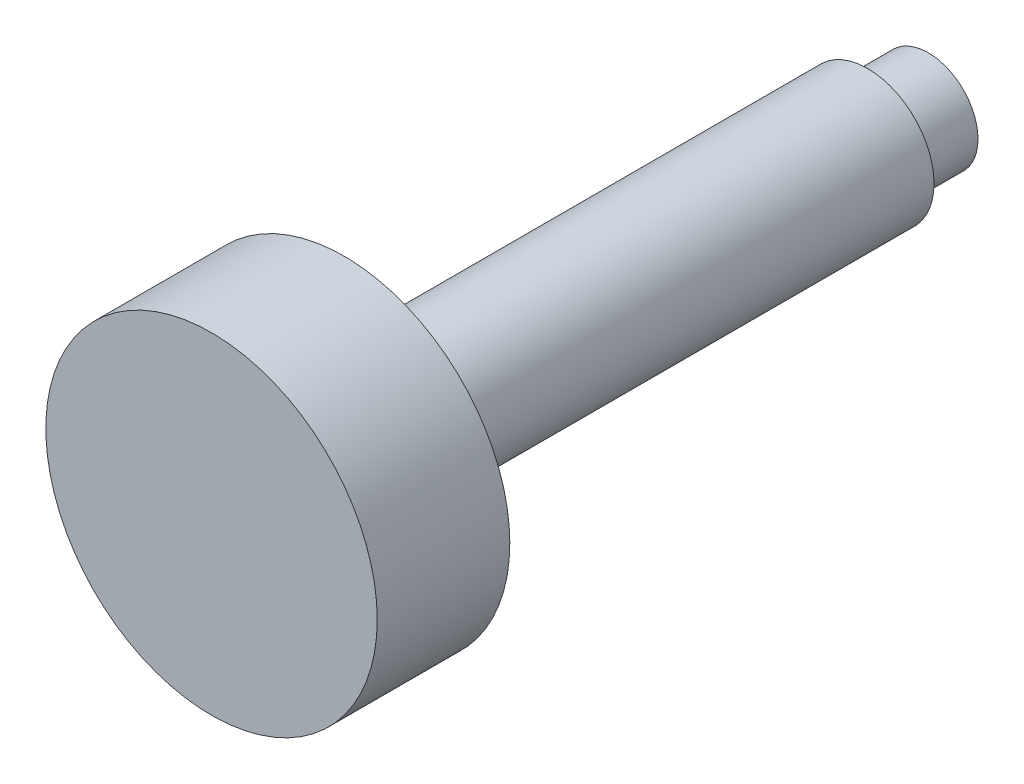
ISO-10303-21;
HEADER;
FILE_DESCRIPTION(('STEP AP214'),'2;1');
FILE_NAME('part.step','',(''),(''),'','','');
FILE_SCHEMA(('AUTOMOTIVE_DESIGN { 1 0 10303 214 1 1 1 1 }'));
ENDSEC;
DATA;
#1=APPLICATION_CONTEXT('core data for automotive mechanical design processes');
#2=APPLICATION_PROTOCOL_DEFINITION('international standard','automotive_design',2000,#1);
#3=PRODUCT_CONTEXT('',#1,'mechanical');
#4=PRODUCT('Part','Part','',(#3));
#5=PRODUCT_RELATED_PRODUCT_CATEGORY('part','',(#4));
#6=PRODUCT_DEFINITION_FORMATION('','',#4);
#7=PRODUCT_DEFINITION_CONTEXT('part definition',#1,'design');
#8=PRODUCT_DEFINITION('design','',#6,#7);
#9=PRODUCT_DEFINITION_SHAPE('','',#8);
#10=(LENGTH_UNIT() NAMED_UNIT(*) SI_UNIT(.MILLI.,.METRE.));
#11=(NAMED_UNIT(*) PLANE_ANGLE_UNIT() SI_UNIT($,.RADIAN.));
#12=(NAMED_UNIT(*) SI_UNIT($,.STERADIAN.) SOLID_ANGLE_UNIT());
#13=UNCERTAINTY_MEASURE_WITH_UNIT(LENGTH_MEASURE(1.E-05),#10,'distance_accuracy_value','');
#14=(GEOMETRIC_REPRESENTATION_CONTEXT(3) GLOBAL_UNCERTAINTY_ASSIGNED_CONTEXT((#13)) GLOBAL_UNIT_ASSIGNED_CONTEXT((#10,
#11,#12)) REPRESENTATION_CONTEXT('',''));
#15=CARTESIAN_POINT('',(0.,0.,0.));
#16=DIRECTION('',(0.,0.,1.));
#17=DIRECTION('',(1.,0.,0.));
#18=AXIS2_PLACEMENT_3D('',#15,#16,#17);
#19=CARTESIAN_POINT('',(0.,0.,8.));
#20=DIRECTION('',(0.,0.,1.));
#21=DIRECTION('',(1.,0.,0.));
#22=AXIS2_PLACEMENT_3D('',#19,#20,#21);
#23=SPHERICAL_SURFACE('',#22,8.);
#24=CARTESIAN_POINT('',(0.,0.,0.933352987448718));
#25=DIRECTION('',(0.,0.,1.));
#26=DIRECTION('',(1.,0.,0.));
#27=AXIS2_PLACEMENT_3D('',#24,#25,#26);
#28=CIRCLE('',#27,3.75);
#29=CARTESIAN_POINT('',(3.75,0.,0.933352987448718));
#30=VERTEX_POINT('',#29);
#31=EDGE_CURVE('E8',#30,#30,#28,.T.);
#32=ORIENTED_EDGE('',*,*,#31,.F.);
#33=EDGE_LOOP('',(#32));
#34=FACE_BOUND('',#33,.T.);
#35=ADVANCED_FACE('F12',(#34),#23,.T.);
#36=CARTESIAN_POINT('',(0.,0.,40.017563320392));
#37=DIRECTION('',(0.,0.,1.));
#38=DIRECTION('',(1.,0.,0.));
#39=AXIS2_PLACEMENT_3D('',#36,#37,#38);
#40=CYLINDRICAL_SURFACE('',#39,3.75);
#41=CARTESIAN_POINT('',(0.,0.,5.5));
#42=DIRECTION('',(0.,0.,1.));
#43=DIRECTION('',(1.,0.,0.));
#44=AXIS2_PLACEMENT_3D('',#41,#42,#43);
#45=CIRCLE('',#44,3.75);
#46=CARTESIAN_POINT('',(3.75,0.,5.5));
#47=VERTEX_POINT('',#46);
#48=EDGE_CURVE('E18',#47,#47,#45,.T.);
#49=ORIENTED_EDGE('',*,*,#48,.F.);
#50=EDGE_LOOP('',(#49));
#51=FACE_BOUND('',#50,.T.);
#52=ORIENTED_EDGE('',*,*,#31,.T.);
#53=EDGE_LOOP('',(#52));
#54=FACE_BOUND('',#53,.T.);
#55=ADVANCED_FACE('F60',(#51,#54),#40,.T.);
#56=CARTESIAN_POINT('',(-3.75,0.,5.5));
#57=DIRECTION('',(0.,0.,1.));
#58=DIRECTION('',(1.,0.,0.));
#59=AXIS2_PLACEMENT_3D('',#56,#57,#58);
#60=PLANE('',#59);
#61=CARTESIAN_POINT('',(0.,0.,5.5));
#62=DIRECTION('',(0.,0.,1.));
#63=DIRECTION('',(1.,0.,0.));
#64=AXIS2_PLACEMENT_3D('',#61,#62,#63);
#65=CIRCLE('',#64,5.);
#66=CARTESIAN_POINT('',(5.,0.,5.5));
#67=VERTEX_POINT('',#66);
#68=EDGE_CURVE('E22',#67,#67,#65,.T.);
#69=ORIENTED_EDGE('',*,*,#68,.F.);
#70=EDGE_LOOP('',(#69));
#71=FACE_BOUND('',#70,.T.);
#72=ORIENTED_EDGE('',*,*,#48,.T.);
#73=EDGE_LOOP('',(#72));
#74=FACE_BOUND('',#73,.T.);
#75=ADVANCED_FACE('F55',(#71,#74),#60,.F.);
#76=CARTESIAN_POINT('',(0.,0.,40.017563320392));
#77=DIRECTION('',(0.,0.,1.));
#78=DIRECTION('',(1.,0.,0.));
#79=AXIS2_PLACEMENT_3D('',#76,#77,#78);
#80=CYLINDRICAL_SURFACE('',#79,5.);
#81=CARTESIAN_POINT('',(0.,0.,45.));
#82=DIRECTION('',(0.,0.,1.));
#83=DIRECTION('',(1.,0.,0.));
#84=AXIS2_PLACEMENT_3D('',#81,#82,#83);
#85=CIRCLE('',#84,5.);
#86=CARTESIAN_POINT('',(5.,0.,45.));
#87=VERTEX_POINT('',#86);
#88=EDGE_CURVE('E26',#87,#87,#85,.T.);
#89=ORIENTED_EDGE('',*,*,#88,.F.);
#90=EDGE_LOOP('',(#89));
#91=FACE_BOUND('',#90,.T.);
#92=ORIENTED_EDGE('',*,*,#68,.T.);
#93=EDGE_LOOP('',(#92));
#94=FACE_BOUND('',#93,.T.);
#95=ADVANCED_FACE('F49',(#91,#94),#80,.T.);
#96=CARTESIAN_POINT('',(-5.,0.,45.));
#97=DIRECTION('',(0.,0.,1.));
#98=DIRECTION('',(1.,0.,0.));
#99=AXIS2_PLACEMENT_3D('',#96,#97,#98);
#100=PLANE('',#99);
#101=CARTESIAN_POINT('',(0.,0.,45.));
#102=DIRECTION('',(0.,0.,1.));
#103=DIRECTION('',(1.,0.,0.));
#104=AXIS2_PLACEMENT_3D('',#101,#102,#103);
#105=CIRCLE('',#104,12.5);
#106=CARTESIAN_POINT('',(12.5,0.,45.));
#107=VERTEX_POINT('',#106);
#108=EDGE_CURVE('E31',#107,#107,#105,.T.);
#109=ORIENTED_EDGE('',*,*,#108,.F.);
#110=EDGE_LOOP('',(#109));
#111=FACE_BOUND('',#110,.T.);
#112=ORIENTED_EDGE('',*,*,#88,.T.);
#113=EDGE_LOOP('',(#112));
#114=FACE_BOUND('',#113,.T.);
#115=ADVANCED_FACE('F43',(#111,#114),#100,.F.);
#116=CARTESIAN_POINT('',(0.,0.,40.017563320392));
#117=DIRECTION('',(0.,0.,1.));
#118=DIRECTION('',(1.,0.,0.));
#119=AXIS2_PLACEMENT_3D('',#116,#117,#118);
#120=CYLINDRICAL_SURFACE('',#119,12.5);
#121=CARTESIAN_POINT('',(0.,0.,55.));
#122=DIRECTION('',(0.,0.,1.));
#123=DIRECTION('',(1.,0.,0.));
#124=AXIS2_PLACEMENT_3D('',#121,#122,#123);
#125=CIRCLE('',#124,12.5);
#126=CARTESIAN_POINT('',(12.5,0.,55.));
#127=VERTEX_POINT('',#126);
#128=EDGE_CURVE('E34',#127,#127,#125,.T.);
#129=ORIENTED_EDGE('',*,*,#128,.F.);
#130=EDGE_LOOP('',(#129));
#131=FACE_BOUND('',#130,.T.);
#132=ORIENTED_EDGE('',*,*,#108,.T.);
#133=EDGE_LOOP('',(#132));
#134=FACE_BOUND('',#133,.T.);
#135=ADVANCED_FACE('F40',(#131,#134),#120,.T.);
#136=CARTESIAN_POINT('',(-12.5,0.,55.));
#137=DIRECTION('',(0.,0.,-1.));
#138=DIRECTION('',(-1.,0.,0.));
#139=AXIS2_PLACEMENT_3D('',#136,#137,#138);
#140=PLANE('',#139);
#141=ORIENTED_EDGE('',*,*,#128,.T.);
#142=EDGE_LOOP('',(#141));
#143=FACE_BOUND('',#142,.T.);
#144=ADVANCED_FACE('F38',(#143),#140,.F.);
#145=CLOSED_SHELL('',(#35,#55,#75,#95,#115,#135,#144));
#146=MANIFOLD_SOLID_BREP('B1',#145);
#147=ADVANCED_BREP_SHAPE_REPRESENTATION('',(#18,#146),#14);
#148=SHAPE_DEFINITION_REPRESENTATION(#9,#147);
ENDSEC;
END-ISO-10303-21;
